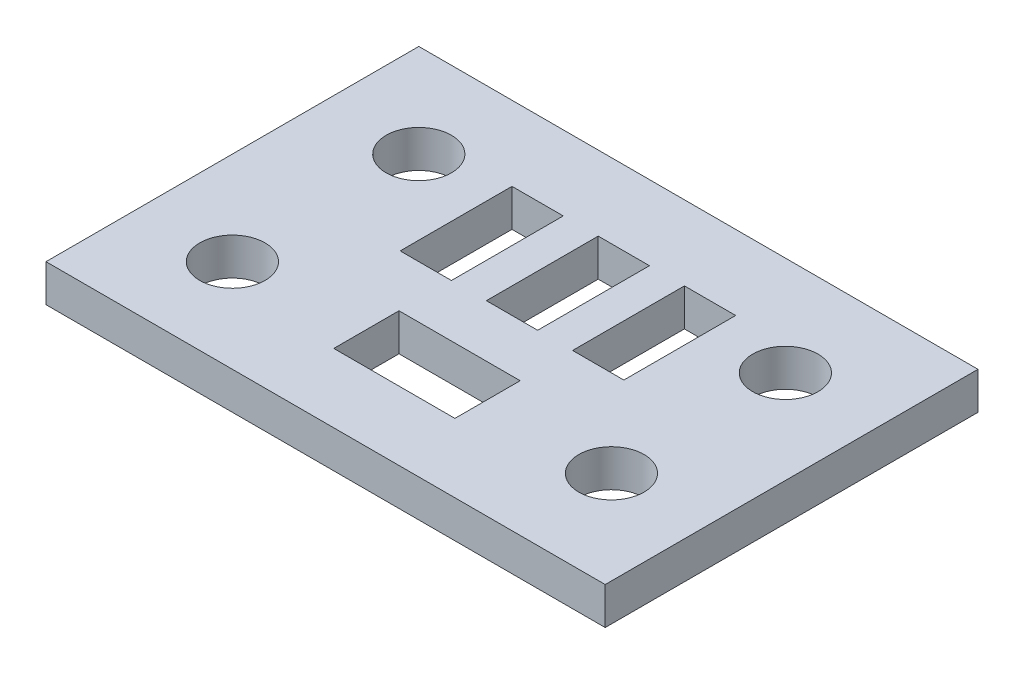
from build123d import *

# Parameters (mm, degrees)
ESQUISSE1_W        = 30
ESQUISSE1_H        = 20
ESQUISSE1_R        = 1.75
ESQUISSE1_W_2      = 2.75
ESQUISSE1_H_2      = 6
ESQUISSE1_W_3      = 6.5
ESQUISSE1_H_3      = 3.5
BOSS_EXTRU_2_DEPTH = 2


with BuildPart() as part:
    # Esquisse1 → Boss.-Extru.2 (new body)
    with BuildSketch(Plane(origin=(0, 0, 0), x_dir=(1, 0, 0), z_dir=(0, 1, 0))):
        with Locations((15, 10)):
            Rectangle(ESQUISSE1_W, ESQUISSE1_H)
        with Locations(Location((5, 15, 0), (0, 0, 270))):
            Circle(ESQUISSE1_R, mode=Mode.SUBTRACT)
        with Locations(Location((25, 14.665584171, 0), (0, 0, 90))):
            Circle(ESQUISSE1_R, mode=Mode.SUBTRACT)
        with Locations(Location((25, 5.334415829, 0), (0, 0, 270))):
            Circle(ESQUISSE1_R, mode=Mode.SUBTRACT)
        with Locations(Location((5, 5, 0), (0, 0, 90))):
            Circle(ESQUISSE1_R, mode=Mode.SUBTRACT)
        with Locations((10.375, 13)):
            Rectangle(ESQUISSE1_W_2, ESQUISSE1_H_2, mode=Mode.SUBTRACT)
        with Locations((15, 5.437978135)):
            Rectangle(ESQUISSE1_W_3, ESQUISSE1_H_3, mode=Mode.SUBTRACT)
        with Locations((19.625, 13)):
            Rectangle(ESQUISSE1_W_2, ESQUISSE1_H_2, mode=Mode.SUBTRACT)
        with Locations((15, 13)):
            Rectangle(ESQUISSE1_W_2, ESQUISSE1_H_2, mode=Mode.SUBTRACT)
    extrude(amount=BOSS_EXTRU_2_DEPTH)


solid = part.part
